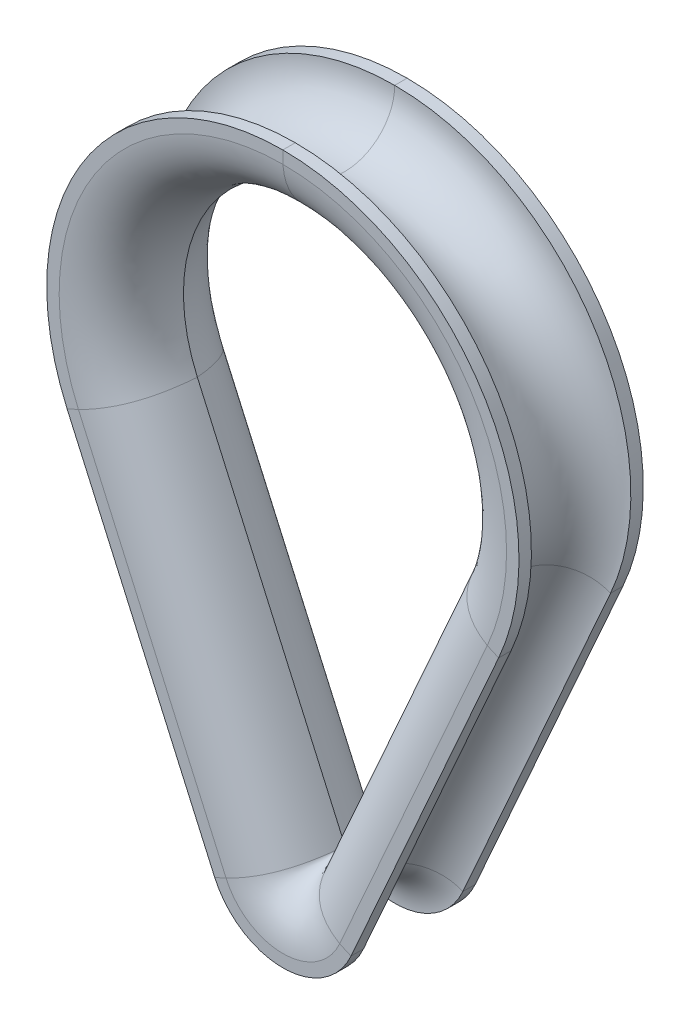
ISO-10303-21;
HEADER;
FILE_DESCRIPTION(('STEP AP214'),'2;1');
FILE_NAME('part.step','',(''),(''),'','','');
FILE_SCHEMA(('AUTOMOTIVE_DESIGN { 1 0 10303 214 1 1 1 1 }'));
ENDSEC;
DATA;
#1=APPLICATION_CONTEXT('core data for automotive mechanical design processes');
#2=APPLICATION_PROTOCOL_DEFINITION('international standard','automotive_design',2000,#1);
#3=PRODUCT_CONTEXT('',#1,'mechanical');
#4=PRODUCT('Part','Part','',(#3));
#5=PRODUCT_RELATED_PRODUCT_CATEGORY('part','',(#4));
#6=PRODUCT_DEFINITION_FORMATION('','',#4);
#7=PRODUCT_DEFINITION_CONTEXT('part definition',#1,'design');
#8=PRODUCT_DEFINITION('design','',#6,#7);
#9=PRODUCT_DEFINITION_SHAPE('','',#8);
#10=(LENGTH_UNIT() NAMED_UNIT(*) SI_UNIT(.MILLI.,.METRE.));
#11=(NAMED_UNIT(*) PLANE_ANGLE_UNIT() SI_UNIT($,.RADIAN.));
#12=(NAMED_UNIT(*) SI_UNIT($,.STERADIAN.) SOLID_ANGLE_UNIT());
#13=UNCERTAINTY_MEASURE_WITH_UNIT(LENGTH_MEASURE(1.E-05),#10,'distance_accuracy_value','');
#14=(GEOMETRIC_REPRESENTATION_CONTEXT(3) GLOBAL_UNCERTAINTY_ASSIGNED_CONTEXT((#13)) GLOBAL_UNIT_ASSIGNED_CONTEXT((#10,
#11,#12)) REPRESENTATION_CONTEXT('',''));
#15=CARTESIAN_POINT('',(0.,0.,0.));
#16=DIRECTION('',(0.,0.,1.));
#17=DIRECTION('',(1.,0.,0.));
#18=AXIS2_PLACEMENT_3D('',#15,#16,#17);
#19=CARTESIAN_POINT('',(0.,0.,0.));
#20=DIRECTION('',(0.,0.,-1.));
#21=DIRECTION('',(-1.,0.,0.));
#22=AXIS2_PLACEMENT_3D('',#19,#20,#21);
#23=CYLINDRICAL_SURFACE('',#22,19.);
#24=CARTESIAN_POINT('',(0.,0.,4.));
#25=DIRECTION('',(0.,0.,-1.));
#26=DIRECTION('',(-0.913761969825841,-0.40625,0.));
#27=AXIS2_PLACEMENT_3D('',#24,#25,#26);
#28=CIRCLE('',#27,19.);
#29=CARTESIAN_POINT('',(-17.361477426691,-7.71874999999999,4.));
#30=VERTEX_POINT('',#29);
#31=CARTESIAN_POINT('',(0.,19.,4.));
#32=VERTEX_POINT('',#31);
#33=EDGE_CURVE('E11',#30,#32,#28,.T.);
#34=ORIENTED_EDGE('',*,*,#33,.F.);
#35=DIRECTION('',(0.,0.,1.));
#36=VECTOR('',#35,1.);
#37=CARTESIAN_POINT('',(-17.361477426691,-7.71875,5.));
#38=LINE('',#37,#36);
#39=CARTESIAN_POINT('',(-17.361477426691,-7.71874999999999,5.));
#40=VERTEX_POINT('',#39);
#41=EDGE_CURVE('E45',#30,#40,#38,.T.);
#42=ORIENTED_EDGE('',*,*,#41,.T.);
#43=CARTESIAN_POINT('',(0.,0.,5.));
#44=DIRECTION('',(0.,0.,-1.));
#45=DIRECTION('',(-0.913761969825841,-0.40625,0.));
#46=AXIS2_PLACEMENT_3D('',#43,#44,#45);
#47=CIRCLE('',#46,19.);
#48=CARTESIAN_POINT('',(0.,19.,5.));
#49=VERTEX_POINT('',#48);
#50=EDGE_CURVE('E211',#40,#49,#47,.T.);
#51=ORIENTED_EDGE('',*,*,#50,.T.);
#52=DIRECTION('',(0.,0.,1.));
#53=VECTOR('',#52,1.);
#54=CARTESIAN_POINT('',(0.,19.,5.));
#55=LINE('',#54,#53);
#56=EDGE_CURVE('E389',#32,#49,#55,.T.);
#57=ORIENTED_EDGE('',*,*,#56,.F.);
#58=EDGE_LOOP('',(#34,#42,#51,#57));
#59=FACE_BOUND('',#58,.T.);
#60=ADVANCED_FACE('F39',(#59),#23,.T.);
#61=CARTESIAN_POINT('',(0.,0.,0.));
#62=DIRECTION('',(0.,0.,-1.));
#63=DIRECTION('',(-1.,0.,0.));
#64=AXIS2_PLACEMENT_3D('',#61,#62,#63);
#65=TOROIDAL_SURFACE('',#64,19.,4.);
#66=CARTESIAN_POINT('',(0.,0.,-4.));
#67=DIRECTION('',(0.,0.,-1.));
#68=DIRECTION('',(-0.913761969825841,-0.40625,0.));
#69=AXIS2_PLACEMENT_3D('',#66,#67,#68);
#70=CIRCLE('',#69,19.);
#71=CARTESIAN_POINT('',(-17.361477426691,-7.71874999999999,-4.));
#72=VERTEX_POINT('',#71);
#73=CARTESIAN_POINT('',(0.,19.,-4.));
#74=VERTEX_POINT('',#73);
#75=EDGE_CURVE('E50',#72,#74,#70,.T.);
#76=ORIENTED_EDGE('',*,*,#75,.F.);
#77=CARTESIAN_POINT('',(-17.361477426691,-7.71875,0.));
#78=DIRECTION('',(0.40625,-0.913761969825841,0.));
#79=DIRECTION('',(0.,0.,-1.));
#80=AXIS2_PLACEMENT_3D('',#77,#78,#79);
#81=CIRCLE('',#80,4.);
#82=EDGE_CURVE('E383',#72,#30,#81,.T.);
#83=ORIENTED_EDGE('',*,*,#82,.T.);
#84=ORIENTED_EDGE('',*,*,#33,.T.);
#85=CARTESIAN_POINT('',(0.,19.,0.));
#86=DIRECTION('',(-1.,0.,0.));
#87=DIRECTION('',(0.,0.,-1.));
#88=AXIS2_PLACEMENT_3D('',#85,#86,#87);
#89=CIRCLE('',#88,4.);
#90=EDGE_CURVE('E365',#74,#32,#89,.T.);
#91=ORIENTED_EDGE('',*,*,#90,.F.);
#92=EDGE_LOOP('',(#76,#83,#84,#91));
#93=FACE_BOUND('',#92,.T.);
#94=ADVANCED_FACE('F457',(#93),#65,.F.);
#95=CARTESIAN_POINT('',(0.,0.,0.));
#96=DIRECTION('',(0.,0.,-1.));
#97=DIRECTION('',(-1.,0.,0.));
#98=AXIS2_PLACEMENT_3D('',#95,#96,#97);
#99=CYLINDRICAL_SURFACE('',#98,19.);
#100=CARTESIAN_POINT('',(0.,0.,-5.));
#101=DIRECTION('',(0.,0.,-1.));
#102=DIRECTION('',(-0.913761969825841,-0.40625,0.));
#103=AXIS2_PLACEMENT_3D('',#100,#101,#102);
#104=CIRCLE('',#103,19.);
#105=CARTESIAN_POINT('',(-17.361477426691,-7.71874999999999,-5.));
#106=VERTEX_POINT('',#105);
#107=CARTESIAN_POINT('',(0.,19.,-5.));
#108=VERTEX_POINT('',#107);
#109=EDGE_CURVE('E338',#106,#108,#104,.T.);
#110=ORIENTED_EDGE('',*,*,#109,.F.);
#111=DIRECTION('',(0.,0.,1.));
#112=VECTOR('',#111,1.);
#113=CARTESIAN_POINT('',(-17.361477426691,-7.71875,-5.));
#114=LINE('',#113,#112);
#115=EDGE_CURVE('E360',#106,#72,#114,.T.);
#116=ORIENTED_EDGE('',*,*,#115,.T.);
#117=ORIENTED_EDGE('',*,*,#75,.T.);
#118=DIRECTION('',(0.,0.,1.));
#119=VECTOR('',#118,1.);
#120=CARTESIAN_POINT('',(0.,19.,-5.));
#121=LINE('',#120,#119);
#122=EDGE_CURVE('E342',#108,#74,#121,.T.);
#123=ORIENTED_EDGE('',*,*,#122,.F.);
#124=EDGE_LOOP('',(#110,#116,#117,#123));
#125=FACE_BOUND('',#124,.T.);
#126=ADVANCED_FACE('F462',(#125),#99,.T.);
#127=CARTESIAN_POINT('',(-17.361477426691,-7.71875,-5.));
#128=DIRECTION('',(0.,0.,-1.));
#129=DIRECTION('',(-1.,0.,0.));
#130=AXIS2_PLACEMENT_3D('',#127,#128,#129);
#131=PLANE('',#130);
#132=CARTESIAN_POINT('',(0.,0.,-5.));
#133=DIRECTION('',(0.,0.,-1.));
#134=DIRECTION('',(-0.913761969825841,-0.40625,0.));
#135=AXIS2_PLACEMENT_3D('',#132,#133,#134);
#136=CIRCLE('',#135,18.);
#137=CARTESIAN_POINT('',(-16.4477154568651,-7.31249999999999,-5.));
#138=VERTEX_POINT('',#137);
#139=CARTESIAN_POINT('',(0.,18.,-5.));
#140=VERTEX_POINT('',#139);
#141=EDGE_CURVE('E175',#138,#140,#136,.T.);
#142=ORIENTED_EDGE('',*,*,#141,.F.);
#143=DIRECTION('',(-0.913761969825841,-0.40625,0.));
#144=VECTOR('',#143,1.);
#145=CARTESIAN_POINT('',(-17.361477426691,-7.71875,-5.));
#146=LINE('',#145,#144);
#147=EDGE_CURVE('E337',#138,#106,#146,.T.);
#148=ORIENTED_EDGE('',*,*,#147,.T.);
#149=ORIENTED_EDGE('',*,*,#109,.T.);
#150=DIRECTION('',(0.,1.,0.));
#151=VECTOR('',#150,1.);
#152=CARTESIAN_POINT('',(0.,19.,-5.));
#153=LINE('',#152,#151);
#154=EDGE_CURVE('E293',#140,#108,#153,.T.);
#155=ORIENTED_EDGE('',*,*,#154,.F.);
#156=EDGE_LOOP('',(#142,#148,#149,#155));
#157=FACE_BOUND('',#156,.T.);
#158=ADVANCED_FACE('F469',(#157),#131,.T.);
#159=CARTESIAN_POINT('',(-11.8789056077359,-5.28125,0.));
#160=CARTESIAN_POINT('',(-16.1172272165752,4.25183825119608,0.));
#161=CARTESIAN_POINT('',(-10.4327916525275,13.,0.));
#162=CARTESIAN_POINT('',(0.,13.,0.));
#163=CARTESIAN_POINT('',(-12.6159607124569,-5.60893778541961,-4.6540376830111));
#164=CARTESIAN_POINT('',(-17.1172591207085,4.51565372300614,-4.6540376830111));
#165=CARTESIAN_POINT('',(-11.0801191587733,13.8066160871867,-4.6540376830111));
#166=CARTESIAN_POINT('',(0.,13.8066160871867,-4.6540376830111));
#167=CARTESIAN_POINT('',(-16.4477154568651,-7.3125,-5.));
#168=CARTESIAN_POINT('',(-22.3161607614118,5.88716065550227,-5.));
#169=CARTESIAN_POINT('',(-14.4454038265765,18.,-5.));
#170=CARTESIAN_POINT('',(0.,18.,-5.));
#171=(BOUNDED_SURFACE() B_SPLINE_SURFACE(2,3,((#159,#160,#161,#162),(#163,#164,#165,#166),(#167,
#168,#169,#170)),.UNSPECIFIED.,.F.,.F.,.F.) B_SPLINE_SURFACE_WITH_KNOTS((3,3),(4,4),(0.,1.),(0.,
1.),.UNSPECIFIED.) GEOMETRIC_REPRESENTATION_ITEM() RATIONAL_B_SPLINE_SURFACE(((1.,
0.696574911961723,0.696574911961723,1.),(1.,0.696574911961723,0.696574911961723,1.),(1.,
0.696574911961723,0.696574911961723,1.))) REPRESENTATION_ITEM('') SURFACE());
#172=CARTESIAN_POINT('',(0.,0.,0.));
#173=DIRECTION('',(0.,0.,-1.));
#174=DIRECTION('',(-0.913761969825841,-0.40625,0.));
#175=AXIS2_PLACEMENT_3D('',#172,#173,#174);
#176=CIRCLE('',#175,13.);
#177=CARTESIAN_POINT('',(-11.8789056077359,-5.28124999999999,0.));
#178=VERTEX_POINT('',#177);
#179=CARTESIAN_POINT('',(0.,13.,0.));
#180=VERTEX_POINT('',#179);
#181=EDGE_CURVE('E185',#178,#180,#176,.T.);
#182=CARTESIAN_POINT('',(-11.8789056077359,-5.28125,0.));
#183=CARTESIAN_POINT('',(-12.6159607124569,-5.60893778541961,-4.6540376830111));
#184=CARTESIAN_POINT('',(-16.4477154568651,-7.3125,-5.));
#185=B_SPLINE_CURVE_WITH_KNOTS('',2,(#182,#183,#184),.UNSPECIFIED.,.F.,.F.,(3,3),(0.,1.),.UNSPECIFIED.);
#186=EDGE_CURVE('E288',#178,#138,#185,.T.);
#187=CARTESIAN_POINT('',(0.,13.,0.));
#188=CARTESIAN_POINT('',(0.,13.8066160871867,-4.6540376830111));
#189=CARTESIAN_POINT('',(0.,18.,-5.));
#190=B_SPLINE_CURVE_WITH_KNOTS('',2,(#187,#188,#189),.UNSPECIFIED.,.F.,.F.,(3,3),(0.,1.),.UNSPECIFIED.);
#191=EDGE_CURVE('E246',#180,#140,#190,.T.);
#192=ORIENTED_EDGE('',*,*,#181,.F.);
#193=ORIENTED_EDGE('',*,*,#186,.T.);
#194=ORIENTED_EDGE('',*,*,#141,.T.);
#195=ORIENTED_EDGE('',*,*,#191,.F.);
#196=EDGE_LOOP('',(#192,#193,#194,#195));
#197=FACE_BOUND('',#196,.T.);
#198=ADVANCED_FACE('F472',(#197),#171,.T.);
#199=CARTESIAN_POINT('',(-16.4477154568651,-7.3125,5.));
#200=CARTESIAN_POINT('',(-22.3161607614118,5.88716065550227,5.));
#201=CARTESIAN_POINT('',(-14.4454038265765,18.,5.));
#202=CARTESIAN_POINT('',(0.,18.,5.));
#203=CARTESIAN_POINT('',(-12.6159607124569,-5.60893778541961,4.6540376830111));
#204=CARTESIAN_POINT('',(-17.1172591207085,4.51565372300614,4.6540376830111));
#205=CARTESIAN_POINT('',(-11.0801191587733,13.8066160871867,4.6540376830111));
#206=CARTESIAN_POINT('',(0.,13.8066160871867,4.6540376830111));
#207=CARTESIAN_POINT('',(-11.8789056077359,-5.28125,0.));
#208=CARTESIAN_POINT('',(-16.1172272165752,4.25183825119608,0.));
#209=CARTESIAN_POINT('',(-10.4327916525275,13.,0.));
#210=CARTESIAN_POINT('',(0.,13.,0.));
#211=(BOUNDED_SURFACE() B_SPLINE_SURFACE(2,3,((#199,#200,#201,#202),(#203,#204,#205,#206),(#207,
#208,#209,#210)),.UNSPECIFIED.,.F.,.F.,.F.) B_SPLINE_SURFACE_WITH_KNOTS((3,3),(4,4),(0.,1.),(0.,
1.),.UNSPECIFIED.) GEOMETRIC_REPRESENTATION_ITEM() RATIONAL_B_SPLINE_SURFACE(((1.,
0.696574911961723,0.696574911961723,1.),(1.,0.696574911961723,0.696574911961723,1.),(1.,
0.696574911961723,0.696574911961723,1.))) REPRESENTATION_ITEM('') SURFACE());
#212=CARTESIAN_POINT('',(0.,0.,5.));
#213=DIRECTION('',(0.,0.,-1.));
#214=DIRECTION('',(-0.913761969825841,-0.40625,0.));
#215=AXIS2_PLACEMENT_3D('',#212,#213,#214);
#216=CIRCLE('',#215,18.);
#217=CARTESIAN_POINT('',(-16.4477154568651,-7.31249999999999,5.));
#218=VERTEX_POINT('',#217);
#219=CARTESIAN_POINT('',(0.,18.,5.));
#220=VERTEX_POINT('',#219);
#221=EDGE_CURVE('E191',#218,#220,#216,.T.);
#222=CARTESIAN_POINT('',(-16.4477154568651,-7.3125,5.));
#223=CARTESIAN_POINT('',(-12.6159607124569,-5.60893778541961,4.6540376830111));
#224=CARTESIAN_POINT('',(-11.8789056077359,-5.28125,0.));
#225=B_SPLINE_CURVE_WITH_KNOTS('',2,(#222,#223,#224),.UNSPECIFIED.,.F.,.F.,(3,3),(0.,1.),.UNSPECIFIED.);
#226=EDGE_CURVE('E210',#218,#178,#225,.T.);
#227=CARTESIAN_POINT('',(0.,18.,5.));
#228=CARTESIAN_POINT('',(0.,13.8066160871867,4.6540376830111));
#229=CARTESIAN_POINT('',(0.,13.,0.));
#230=B_SPLINE_CURVE_WITH_KNOTS('',2,(#227,#228,#229),.UNSPECIFIED.,.F.,.F.,(3,3),(0.,1.),.UNSPECIFIED.);
#231=EDGE_CURVE('E207',#220,#180,#230,.T.);
#232=ORIENTED_EDGE('',*,*,#221,.F.);
#233=ORIENTED_EDGE('',*,*,#226,.T.);
#234=ORIENTED_EDGE('',*,*,#181,.T.);
#235=ORIENTED_EDGE('',*,*,#231,.F.);
#236=EDGE_LOOP('',(#232,#233,#234,#235));
#237=FACE_BOUND('',#236,.T.);
#238=ADVANCED_FACE('F206',(#237),#211,.T.);
#239=CARTESIAN_POINT('',(-5.48257181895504,-34.4375,5.));
#240=DIRECTION('',(-0.91376196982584,-0.40625,0.));
#241=DIRECTION('',(0.40625,-0.91376196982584,0.));
#242=AXIS2_PLACEMENT_3D('',#239,#240,#241);
#243=PLANE('',#242);
#244=ORIENTED_EDGE('',*,*,#41,.F.);
#245=DIRECTION('',(-0.40625,0.91376196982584,0.));
#246=VECTOR('',#245,1.);
#247=CARTESIAN_POINT('',(-5.48257181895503,-34.4375,4.));
#248=LINE('',#247,#246);
#249=CARTESIAN_POINT('',(-5.48257181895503,-34.4375,4.));
#250=VERTEX_POINT('',#249);
#251=EDGE_CURVE('E404',#250,#30,#248,.T.);
#252=ORIENTED_EDGE('',*,*,#251,.F.);
#253=DIRECTION('',(0.,0.,1.));
#254=VECTOR('',#253,1.);
#255=CARTESIAN_POINT('',(-5.48257181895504,-34.4375,5.));
#256=LINE('',#255,#254);
#257=CARTESIAN_POINT('',(-5.48257181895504,-34.4375,5.));
#258=VERTEX_POINT('',#257);
#259=EDGE_CURVE('E237',#250,#258,#256,.T.);
#260=ORIENTED_EDGE('',*,*,#259,.T.);
#261=DIRECTION('',(-0.40625,0.91376196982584,0.));
#262=VECTOR('',#261,1.);
#263=CARTESIAN_POINT('',(-5.48257181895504,-34.4375,5.));
#264=LINE('',#263,#262);
#265=EDGE_CURVE('E233',#258,#40,#264,.T.);
#266=ORIENTED_EDGE('',*,*,#265,.T.);
#267=EDGE_LOOP('',(#244,#252,#260,#266));
#268=FACE_BOUND('',#267,.T.);
#269=ADVANCED_FACE('F417',(#268),#243,.T.);
#270=CARTESIAN_POINT('',(-5.48257181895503,-34.4375,0.));
#271=DIRECTION('',(-0.40625,0.91376196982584,0.));
#272=DIRECTION('',(-0.91376196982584,-0.40625,0.));
#273=AXIS2_PLACEMENT_3D('',#270,#271,#272);
#274=CYLINDRICAL_SURFACE('',#273,4.);
#275=ORIENTED_EDGE('',*,*,#251,.T.);
#276=ORIENTED_EDGE('',*,*,#82,.F.);
#277=DIRECTION('',(-0.40625,0.91376196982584,0.));
#278=VECTOR('',#277,1.);
#279=CARTESIAN_POINT('',(-5.48257181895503,-34.4375,-4.));
#280=LINE('',#279,#278);
#281=CARTESIAN_POINT('',(-5.48257181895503,-34.4375,-4.));
#282=VERTEX_POINT('',#281);
#283=EDGE_CURVE('E381',#282,#72,#280,.T.);
#284=ORIENTED_EDGE('',*,*,#283,.F.);
#285=CARTESIAN_POINT('',(-5.48257181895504,-34.4375,0.));
#286=DIRECTION('',(0.406250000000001,-0.91376196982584,0.));
#287=DIRECTION('',(0.,0.,-1.));
#288=AXIS2_PLACEMENT_3D('',#285,#286,#287);
#289=CIRCLE('',#288,4.);
#290=EDGE_CURVE('E380',#282,#250,#289,.T.);
#291=ORIENTED_EDGE('',*,*,#290,.T.);
#292=EDGE_LOOP('',(#275,#276,#284,#291));
#293=FACE_BOUND('',#292,.T.);
#294=ADVANCED_FACE('F514',(#293),#274,.F.);
#295=CARTESIAN_POINT('',(-5.48257181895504,-34.4375,-5.));
#296=DIRECTION('',(-0.91376196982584,-0.40625,0.));
#297=DIRECTION('',(0.40625,-0.91376196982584,0.));
#298=AXIS2_PLACEMENT_3D('',#295,#296,#297);
#299=PLANE('',#298);
#300=ORIENTED_EDGE('',*,*,#283,.T.);
#301=ORIENTED_EDGE('',*,*,#115,.F.);
#302=DIRECTION('',(-0.40625,0.91376196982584,0.));
#303=VECTOR('',#302,1.);
#304=CARTESIAN_POINT('',(-5.48257181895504,-34.4375,-5.));
#305=LINE('',#304,#303);
#306=CARTESIAN_POINT('',(-5.48257181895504,-34.4375,-5.));
#307=VERTEX_POINT('',#306);
#308=EDGE_CURVE('E357',#307,#106,#305,.T.);
#309=ORIENTED_EDGE('',*,*,#308,.F.);
#310=DIRECTION('',(0.,0.,1.));
#311=VECTOR('',#310,1.);
#312=CARTESIAN_POINT('',(-5.48257181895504,-34.4375,-5.));
#313=LINE('',#312,#311);
#314=EDGE_CURVE('E354',#307,#282,#313,.T.);
#315=ORIENTED_EDGE('',*,*,#314,.T.);
#316=EDGE_LOOP('',(#300,#301,#309,#315));
#317=FACE_BOUND('',#316,.T.);
#318=ADVANCED_FACE('F526',(#317),#299,.T.);
#319=CARTESIAN_POINT('',(-5.48257181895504,-34.4375,-5.));
#320=DIRECTION('',(0.,0.,-1.));
#321=DIRECTION('',(-1.,0.,0.));
#322=AXIS2_PLACEMENT_3D('',#319,#320,#321);
#323=PLANE('',#322);
#324=ORIENTED_EDGE('',*,*,#308,.T.);
#325=ORIENTED_EDGE('',*,*,#147,.F.);
#326=DIRECTION('',(-0.40625,0.91376196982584,0.));
#327=VECTOR('',#326,1.);
#328=CARTESIAN_POINT('',(-4.5688098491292,-34.03125,-5.));
#329=LINE('',#328,#327);
#330=CARTESIAN_POINT('',(-4.5688098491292,-34.03125,-5.));
#331=VERTEX_POINT('',#330);
#332=EDGE_CURVE('E332',#331,#138,#329,.T.);
#333=ORIENTED_EDGE('',*,*,#332,.F.);
#334=DIRECTION('',(-0.91376196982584,-0.406250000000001,0.));
#335=VECTOR('',#334,1.);
#336=CARTESIAN_POINT('',(-5.48257181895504,-34.4375,-5.));
#337=LINE('',#336,#335);
#338=EDGE_CURVE('E325',#331,#307,#337,.T.);
#339=ORIENTED_EDGE('',*,*,#338,.T.);
#340=EDGE_LOOP('',(#324,#325,#333,#339));
#341=FACE_BOUND('',#340,.T.);
#342=ADVANCED_FACE('F572',(#341),#323,.T.);
#343=CARTESIAN_POINT('',(0.,-32.,0.));
#344=CARTESIAN_POINT('',(-11.8789056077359,-5.28125,0.));
#345=CARTESIAN_POINT('',(-0.737055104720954,-32.3276877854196,-4.6540376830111));
#346=CARTESIAN_POINT('',(-12.6159607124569,-5.60893778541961,-4.6540376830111));
#347=CARTESIAN_POINT('',(-4.5688098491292,-34.03125,-5.));
#348=CARTESIAN_POINT('',(-16.4477154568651,-7.3125,-5.));
#349=B_SPLINE_SURFACE_WITH_KNOTS('',2,1,((#343,#344),(#345,#346),(#347,#348)),.UNSPECIFIED.,.F.,
.F.,.F.,(3,3),(2,2),(0.,1.),(0.,1.),.UNSPECIFIED.);
#350=DIRECTION('',(-0.40625,0.91376196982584,0.));
#351=VECTOR('',#350,1.);
#352=CARTESIAN_POINT('',(0.,-32.,0.));
#353=LINE('',#352,#351);
#354=CARTESIAN_POINT('',(0.,-32.,0.));
#355=VERTEX_POINT('',#354);
#356=EDGE_CURVE('E222',#355,#178,#353,.T.);
#357=CARTESIAN_POINT('',(0.,-32.,0.));
#358=CARTESIAN_POINT('',(-0.73705510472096,-32.3276877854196,-4.6540376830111));
#359=CARTESIAN_POINT('',(-4.5688098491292,-34.03125,-5.));
#360=B_SPLINE_CURVE_WITH_KNOTS('',2,(#357,#358,#359),.UNSPECIFIED.,.F.,.F.,(3,3),(0.,1.),.UNSPECIFIED.);
#361=EDGE_CURVE('E279',#355,#331,#360,.T.);
#362=ORIENTED_EDGE('',*,*,#332,.T.);
#363=ORIENTED_EDGE('',*,*,#186,.F.);
#364=ORIENTED_EDGE('',*,*,#356,.F.);
#365=ORIENTED_EDGE('',*,*,#361,.T.);
#366=EDGE_LOOP('',(#362,#363,#364,#365));
#367=FACE_BOUND('',#366,.T.);
#368=ADVANCED_FACE('F490',(#367),#349,.T.);
#369=CARTESIAN_POINT('',(-4.5688098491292,-34.03125,5.));
#370=CARTESIAN_POINT('',(-16.4477154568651,-7.3125,5.));
#371=CARTESIAN_POINT('',(-0.737055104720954,-32.3276877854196,4.6540376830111));
#372=CARTESIAN_POINT('',(-12.6159607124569,-5.60893778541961,4.6540376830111));
#373=CARTESIAN_POINT('',(0.,-32.,0.));
#374=CARTESIAN_POINT('',(-11.8789056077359,-5.28125,0.));
#375=B_SPLINE_SURFACE_WITH_KNOTS('',2,1,((#369,#370),(#371,#372),(#373,#374)),.UNSPECIFIED.,.F.,
.F.,.F.,(3,3),(2,2),(0.,1.),(0.,1.),.UNSPECIFIED.);
#376=DIRECTION('',(-0.40625,0.91376196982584,0.));
#377=VECTOR('',#376,1.);
#378=CARTESIAN_POINT('',(-4.5688098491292,-34.03125,5.));
#379=LINE('',#378,#377);
#380=CARTESIAN_POINT('',(-4.5688098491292,-34.03125,5.));
#381=VERTEX_POINT('',#380);
#382=EDGE_CURVE('E217',#381,#218,#379,.T.);
#383=CARTESIAN_POINT('',(-4.5688098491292,-34.03125,5.));
#384=CARTESIAN_POINT('',(-0.73705510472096,-32.3276877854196,4.6540376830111));
#385=CARTESIAN_POINT('',(0.,-32.,0.));
#386=B_SPLINE_CURVE_WITH_KNOTS('',2,(#383,#384,#385),.UNSPECIFIED.,.F.,.F.,(3,3),(0.,1.),.UNSPECIFIED.);
#387=EDGE_CURVE('E274',#381,#355,#386,.T.);
#388=ORIENTED_EDGE('',*,*,#356,.T.);
#389=ORIENTED_EDGE('',*,*,#226,.F.);
#390=ORIENTED_EDGE('',*,*,#382,.F.);
#391=ORIENTED_EDGE('',*,*,#387,.T.);
#392=EDGE_LOOP('',(#388,#389,#390,#391));
#393=FACE_BOUND('',#392,.T.);
#394=ADVANCED_FACE('F220',(#393),#375,.T.);
#395=CARTESIAN_POINT('',(-5.48257181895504,-34.4375,5.));
#396=DIRECTION('',(0.,0.,1.));
#397=DIRECTION('',(1.,0.,0.));
#398=AXIS2_PLACEMENT_3D('',#395,#396,#397);
#399=PLANE('',#398);
#400=ORIENTED_EDGE('',*,*,#382,.T.);
#401=DIRECTION('',(0.913761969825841,0.40625,0.));
#402=VECTOR('',#401,1.);
#403=CARTESIAN_POINT('',(-17.361477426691,-7.71875,5.));
#404=LINE('',#403,#402);
#405=EDGE_CURVE('E229',#40,#218,#404,.T.);
#406=ORIENTED_EDGE('',*,*,#405,.F.);
#407=ORIENTED_EDGE('',*,*,#265,.F.);
#408=DIRECTION('',(0.91376196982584,0.406250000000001,0.));
#409=VECTOR('',#408,1.);
#410=CARTESIAN_POINT('',(-5.48257181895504,-34.4375,5.));
#411=LINE('',#410,#409);
#412=EDGE_CURVE('E231',#258,#381,#411,.T.);
#413=ORIENTED_EDGE('',*,*,#412,.T.);
#414=EDGE_LOOP('',(#400,#406,#407,#413));
#415=FACE_BOUND('',#414,.T.);
#416=ADVANCED_FACE('F226',(#415),#399,.T.);
#417=CARTESIAN_POINT('',(0.,-32.,0.));
#418=DIRECTION('',(0.,0.,-1.));
#419=DIRECTION('',(-1.,0.,0.));
#420=AXIS2_PLACEMENT_3D('',#417,#418,#419);
#421=CYLINDRICAL_SURFACE('',#420,6.);
#422=ORIENTED_EDGE('',*,*,#259,.F.);
#423=CARTESIAN_POINT('',(0.,-32.,4.));
#424=DIRECTION('',(0.,0.,-1.));
#425=DIRECTION('',(0.913761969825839,-0.406250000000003,0.));
#426=AXIS2_PLACEMENT_3D('',#423,#424,#425);
#427=CIRCLE('',#426,6.);
#428=CARTESIAN_POINT('',(5.48257181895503,-34.4375,4.));
#429=VERTEX_POINT('',#428);
#430=EDGE_CURVE('E90',#429,#250,#427,.T.);
#431=ORIENTED_EDGE('',*,*,#430,.F.);
#432=DIRECTION('',(0.,0.,1.));
#433=VECTOR('',#432,1.);
#434=CARTESIAN_POINT('',(5.48257181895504,-34.4375,5.));
#435=LINE('',#434,#433);
#436=CARTESIAN_POINT('',(5.48257181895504,-34.4375,5.));
#437=VERTEX_POINT('',#436);
#438=EDGE_CURVE('E398',#429,#437,#435,.T.);
#439=ORIENTED_EDGE('',*,*,#438,.T.);
#440=CARTESIAN_POINT('',(0.,-32.,5.));
#441=DIRECTION('',(0.,0.,-1.));
#442=DIRECTION('',(0.913761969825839,-0.406250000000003,0.));
#443=AXIS2_PLACEMENT_3D('',#440,#441,#442);
#444=CIRCLE('',#443,6.);
#445=EDGE_CURVE('E239',#437,#258,#444,.T.);
#446=ORIENTED_EDGE('',*,*,#445,.T.);
#447=EDGE_LOOP('',(#422,#431,#439,#446));
#448=FACE_BOUND('',#447,.T.);
#449=ADVANCED_FACE('F422',(#448),#421,.T.);
#450=CARTESIAN_POINT('',(0.,-32.,0.));
#451=DIRECTION('',(0.,0.,-1.));
#452=DIRECTION('',(-1.,0.,0.));
#453=AXIS2_PLACEMENT_3D('',#450,#451,#452);
#454=TOROIDAL_SURFACE('',#453,6.,4.);
#455=ORIENTED_EDGE('',*,*,#430,.T.);
#456=ORIENTED_EDGE('',*,*,#290,.F.);
#457=CARTESIAN_POINT('',(0.,-32.,-4.));
#458=DIRECTION('',(0.,0.,-1.));
#459=DIRECTION('',(0.913761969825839,-0.406250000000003,0.));
#460=AXIS2_PLACEMENT_3D('',#457,#458,#459);
#461=CIRCLE('',#460,6.);
#462=CARTESIAN_POINT('',(5.48257181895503,-34.4375,-4.));
#463=VERTEX_POINT('',#462);
#464=EDGE_CURVE('E99',#463,#282,#461,.T.);
#465=ORIENTED_EDGE('',*,*,#464,.F.);
#466=CARTESIAN_POINT('',(5.48257181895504,-34.4375,0.));
#467=DIRECTION('',(0.40625,0.91376196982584,0.));
#468=DIRECTION('',(0.,0.,-1.));
#469=AXIS2_PLACEMENT_3D('',#466,#467,#468);
#470=CIRCLE('',#469,4.);
#471=EDGE_CURVE('E372',#463,#429,#470,.T.);
#472=ORIENTED_EDGE('',*,*,#471,.T.);
#473=EDGE_LOOP('',(#455,#456,#465,#472));
#474=FACE_BOUND('',#473,.T.);
#475=ADVANCED_FACE('F522',(#474),#454,.F.);
#476=CARTESIAN_POINT('',(0.,-32.,0.));
#477=DIRECTION('',(0.,0.,-1.));
#478=DIRECTION('',(-1.,0.,0.));
#479=AXIS2_PLACEMENT_3D('',#476,#477,#478);
#480=CYLINDRICAL_SURFACE('',#479,6.);
#481=ORIENTED_EDGE('',*,*,#464,.T.);
#482=ORIENTED_EDGE('',*,*,#314,.F.);
#483=CARTESIAN_POINT('',(0.,-32.,-5.));
#484=DIRECTION('',(0.,0.,-1.));
#485=DIRECTION('',(0.913761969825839,-0.406250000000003,0.));
#486=AXIS2_PLACEMENT_3D('',#483,#484,#485);
#487=CIRCLE('',#486,6.);
#488=CARTESIAN_POINT('',(5.48257181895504,-34.4375,-5.));
#489=VERTEX_POINT('',#488);
#490=EDGE_CURVE('E108',#489,#307,#487,.T.);
#491=ORIENTED_EDGE('',*,*,#490,.F.);
#492=DIRECTION('',(0.,0.,1.));
#493=VECTOR('',#492,1.);
#494=CARTESIAN_POINT('',(5.48257181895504,-34.4375,-5.));
#495=LINE('',#494,#493);
#496=EDGE_CURVE('E348',#489,#463,#495,.T.);
#497=ORIENTED_EDGE('',*,*,#496,.T.);
#498=EDGE_LOOP('',(#481,#482,#491,#497));
#499=FACE_BOUND('',#498,.T.);
#500=ADVANCED_FACE('F571',(#499),#480,.T.);
#501=CARTESIAN_POINT('',(5.48257181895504,-34.4375,-5.));
#502=DIRECTION('',(0.,0.,-1.));
#503=DIRECTION('',(-1.,0.,0.));
#504=AXIS2_PLACEMENT_3D('',#501,#502,#503);
#505=PLANE('',#504);
#506=ORIENTED_EDGE('',*,*,#490,.T.);
#507=ORIENTED_EDGE('',*,*,#338,.F.);
#508=CARTESIAN_POINT('',(0.,-32.,-5.));
#509=DIRECTION('',(0.,0.,-1.));
#510=DIRECTION('',(0.913761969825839,-0.406250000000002,0.));
#511=AXIS2_PLACEMENT_3D('',#508,#509,#510);
#512=CIRCLE('',#511,5.);
#513=CARTESIAN_POINT('',(4.5688098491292,-34.03125,-5.));
#514=VERTEX_POINT('',#513);
#515=EDGE_CURVE('E126',#514,#331,#512,.T.);
#516=ORIENTED_EDGE('',*,*,#515,.F.);
#517=DIRECTION('',(0.91376196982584,-0.40625,0.));
#518=VECTOR('',#517,1.);
#519=CARTESIAN_POINT('',(5.48257181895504,-34.4375,-5.));
#520=LINE('',#519,#518);
#521=EDGE_CURVE('E320',#514,#489,#520,.T.);
#522=ORIENTED_EDGE('',*,*,#521,.T.);
#523=EDGE_LOOP('',(#506,#507,#516,#522));
#524=FACE_BOUND('',#523,.T.);
#525=ADVANCED_FACE('F566',(#524),#505,.T.);
#526=CARTESIAN_POINT('',(0.,-32.,0.));
#527=CARTESIAN_POINT('',(0.,-32.,0.));
#528=CARTESIAN_POINT('',(0.,-32.,0.));
#529=CARTESIAN_POINT('',(0.,-32.,0.));
#530=CARTESIAN_POINT('',(0.737055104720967,-32.3276877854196,-4.6540376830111));
#531=CARTESIAN_POINT('',(0.406651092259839,-33.07085239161,-4.6540376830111));
#532=CARTESIAN_POINT('',(-0.40665109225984,-33.07085239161,-4.65403768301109));
#533=CARTESIAN_POINT('',(-0.737055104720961,-32.3276877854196,-4.65403768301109));
#534=CARTESIAN_POINT('',(4.5688098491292,-34.03125,-5.));
#535=CARTESIAN_POINT('',(2.52072267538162,-38.6379310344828,-5.));
#536=CARTESIAN_POINT('',(-2.52072267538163,-38.6379310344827,-5.));
#537=CARTESIAN_POINT('',(-4.5688098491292,-34.03125,-5.));
#538=(BOUNDED_SURFACE() B_SPLINE_SURFACE(2,3,((#526,#527,#528,#529),(#530,#531,#532,#533),(#534,
#535,#536,#537)),.UNSPECIFIED.,.F.,.F.,.F.) B_SPLINE_SURFACE_WITH_KNOTS((3,3),(4,4),(0.,1.),(0.,
1.),.UNSPECIFIED.) GEOMETRIC_REPRESENTATION_ITEM() RATIONAL_B_SPLINE_SURFACE(((1.,
0.604166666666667,0.604166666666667,1.),(1.,0.604166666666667,0.604166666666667,1.),(1.,
0.604166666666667,0.604166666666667,1.))) REPRESENTATION_ITEM('') SURFACE());
#539=CARTESIAN_POINT('',(0.,-32.,0.));
#540=CARTESIAN_POINT('',(0.737055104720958,-32.3276877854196,-4.6540376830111));
#541=CARTESIAN_POINT('',(4.5688098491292,-34.03125,-5.));
#542=B_SPLINE_CURVE_WITH_KNOTS('',2,(#539,#540,#541),.UNSPECIFIED.,.F.,.F.,(3,3),(0.,1.),.UNSPECIFIED.);
#543=EDGE_CURVE('E273',#355,#514,#542,.T.);
#544=ORIENTED_EDGE('',*,*,#515,.T.);
#545=ORIENTED_EDGE('',*,*,#361,.F.);
#546=ORIENTED_EDGE('',*,*,#543,.T.);
#547=EDGE_LOOP('',(#544,#545,#546));
#548=FACE_BOUND('',#547,.T.);
#549=ADVANCED_FACE('F482',(#548),#538,.T.);
#550=CARTESIAN_POINT('',(4.5688098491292,-34.03125,5.));
#551=CARTESIAN_POINT('',(2.52072267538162,-38.6379310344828,5.));
#552=CARTESIAN_POINT('',(-2.52072267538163,-38.6379310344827,5.));
#553=CARTESIAN_POINT('',(-4.5688098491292,-34.03125,5.));
#554=CARTESIAN_POINT('',(0.737055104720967,-32.3276877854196,4.6540376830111));
#555=CARTESIAN_POINT('',(0.406651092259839,-33.07085239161,4.6540376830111));
#556=CARTESIAN_POINT('',(-0.40665109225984,-33.07085239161,4.65403768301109));
#557=CARTESIAN_POINT('',(-0.737055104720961,-32.3276877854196,4.65403768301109));
#558=CARTESIAN_POINT('',(0.,-32.,0.));
#559=CARTESIAN_POINT('',(0.,-32.,0.));
#560=CARTESIAN_POINT('',(0.,-32.,0.));
#561=CARTESIAN_POINT('',(0.,-32.,0.));
#562=(BOUNDED_SURFACE() B_SPLINE_SURFACE(2,3,((#550,#551,#552,#553),(#554,#555,#556,#557),(#558,
#559,#560,#561)),.UNSPECIFIED.,.F.,.F.,.F.) B_SPLINE_SURFACE_WITH_KNOTS((3,3),(4,4),(0.,1.),(0.,
1.),.UNSPECIFIED.) GEOMETRIC_REPRESENTATION_ITEM() RATIONAL_B_SPLINE_SURFACE(((1.,
0.604166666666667,0.604166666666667,1.),(1.,0.604166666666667,0.604166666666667,1.),(1.,
0.604166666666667,0.604166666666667,1.))) REPRESENTATION_ITEM('') SURFACE());
#563=CARTESIAN_POINT('',(4.5688098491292,-34.03125,5.));
#564=CARTESIAN_POINT('',(0.737055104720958,-32.3276877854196,4.6540376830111));
#565=CARTESIAN_POINT('',(0.,-32.,0.));
#566=B_SPLINE_CURVE_WITH_KNOTS('',2,(#563,#564,#565),.UNSPECIFIED.,.F.,.F.,(3,3),(0.,1.),.UNSPECIFIED.);
#567=CARTESIAN_POINT('',(4.5688098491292,-34.03125,5.));
#568=VERTEX_POINT('',#567);
#569=EDGE_CURVE('E262',#568,#355,#566,.T.);
#570=CARTESIAN_POINT('',(0.,-32.,5.));
#571=DIRECTION('',(0.,0.,-1.));
#572=DIRECTION('',(0.913761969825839,-0.406250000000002,0.));
#573=AXIS2_PLACEMENT_3D('',#570,#571,#572);
#574=CIRCLE('',#573,5.);
#575=EDGE_CURVE('E330',#568,#381,#574,.T.);
#576=ORIENTED_EDGE('',*,*,#569,.T.);
#577=ORIENTED_EDGE('',*,*,#387,.F.);
#578=ORIENTED_EDGE('',*,*,#575,.F.);
#579=EDGE_LOOP('',(#576,#577,#578));
#580=FACE_BOUND('',#579,.T.);
#581=ADVANCED_FACE('F481',(#580),#562,.T.);
#582=CARTESIAN_POINT('',(5.48257181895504,-34.4375,5.));
#583=DIRECTION('',(0.,0.,1.));
#584=DIRECTION('',(1.,0.,0.));
#585=AXIS2_PLACEMENT_3D('',#582,#583,#584);
#586=PLANE('',#585);
#587=ORIENTED_EDGE('',*,*,#575,.T.);
#588=ORIENTED_EDGE('',*,*,#412,.F.);
#589=ORIENTED_EDGE('',*,*,#445,.F.);
#590=DIRECTION('',(-0.91376196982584,0.40625,0.));
#591=VECTOR('',#590,1.);
#592=CARTESIAN_POINT('',(5.48257181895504,-34.4375,5.));
#593=LINE('',#592,#591);
#594=EDGE_CURVE('E435',#437,#568,#593,.T.);
#595=ORIENTED_EDGE('',*,*,#594,.T.);
#596=EDGE_LOOP('',(#587,#588,#589,#595));
#597=FACE_BOUND('',#596,.T.);
#598=ADVANCED_FACE('F419',(#597),#586,.T.);
#599=CARTESIAN_POINT('',(17.361477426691,-7.71875,5.));
#600=DIRECTION('',(0.91376196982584,-0.40625,0.));
#601=DIRECTION('',(0.40625,0.913761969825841,0.));
#602=AXIS2_PLACEMENT_3D('',#599,#600,#601);
#603=PLANE('',#602);
#604=ORIENTED_EDGE('',*,*,#438,.F.);
#605=DIRECTION('',(-0.40625,-0.913761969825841,0.));
#606=VECTOR('',#605,1.);
#607=CARTESIAN_POINT('',(17.361477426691,-7.71875,4.));
#608=LINE('',#607,#606);
#609=CARTESIAN_POINT('',(17.361477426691,-7.71875,4.));
#610=VERTEX_POINT('',#609);
#611=EDGE_CURVE('E396',#610,#429,#608,.T.);
#612=ORIENTED_EDGE('',*,*,#611,.F.);
#613=DIRECTION('',(0.,0.,1.));
#614=VECTOR('',#613,1.);
#615=CARTESIAN_POINT('',(17.361477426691,-7.71875,5.));
#616=LINE('',#615,#614);
#617=CARTESIAN_POINT('',(17.361477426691,-7.71875,5.));
#618=VERTEX_POINT('',#617);
#619=EDGE_CURVE('E393',#610,#618,#616,.T.);
#620=ORIENTED_EDGE('',*,*,#619,.T.);
#621=DIRECTION('',(-0.40625,-0.913761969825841,0.));
#622=VECTOR('',#621,1.);
#623=CARTESIAN_POINT('',(17.361477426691,-7.71875,5.));
#624=LINE('',#623,#622);
#625=EDGE_CURVE('E412',#618,#437,#624,.T.);
#626=ORIENTED_EDGE('',*,*,#625,.T.);
#627=EDGE_LOOP('',(#604,#612,#620,#626));
#628=FACE_BOUND('',#627,.T.);
#629=ADVANCED_FACE('F436',(#628),#603,.T.);
#630=CARTESIAN_POINT('',(17.361477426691,-7.71875,0.));
#631=DIRECTION('',(-0.40625,-0.91376196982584,0.));
#632=DIRECTION('',(0.913761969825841,-0.40625,0.));
#633=AXIS2_PLACEMENT_3D('',#630,#631,#632);
#634=CYLINDRICAL_SURFACE('',#633,4.);
#635=ORIENTED_EDGE('',*,*,#611,.T.);
#636=ORIENTED_EDGE('',*,*,#471,.F.);
#637=DIRECTION('',(-0.40625,-0.913761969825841,0.));
#638=VECTOR('',#637,1.);
#639=CARTESIAN_POINT('',(17.361477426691,-7.71875,-4.));
#640=LINE('',#639,#638);
#641=CARTESIAN_POINT('',(17.361477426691,-7.71875,-4.));
#642=VERTEX_POINT('',#641);
#643=EDGE_CURVE('E371',#642,#463,#640,.T.);
#644=ORIENTED_EDGE('',*,*,#643,.F.);
#645=CARTESIAN_POINT('',(17.361477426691,-7.71875,0.));
#646=DIRECTION('',(0.40625,0.91376196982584,0.));
#647=DIRECTION('',(0.,0.,-1.));
#648=AXIS2_PLACEMENT_3D('',#645,#646,#647);
#649=CIRCLE('',#648,4.);
#650=EDGE_CURVE('E369',#642,#610,#649,.T.);
#651=ORIENTED_EDGE('',*,*,#650,.T.);
#652=EDGE_LOOP('',(#635,#636,#644,#651));
#653=FACE_BOUND('',#652,.T.);
#654=ADVANCED_FACE('F520',(#653),#634,.F.);
#655=CARTESIAN_POINT('',(17.361477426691,-7.71875,-5.));
#656=DIRECTION('',(0.91376196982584,-0.40625,0.));
#657=DIRECTION('',(0.40625,0.913761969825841,0.));
#658=AXIS2_PLACEMENT_3D('',#655,#656,#657);
#659=PLANE('',#658);
#660=ORIENTED_EDGE('',*,*,#643,.T.);
#661=ORIENTED_EDGE('',*,*,#496,.F.);
#662=DIRECTION('',(-0.40625,-0.913761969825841,0.));
#663=VECTOR('',#662,1.);
#664=CARTESIAN_POINT('',(17.361477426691,-7.71875,-5.));
#665=LINE('',#664,#663);
#666=CARTESIAN_POINT('',(17.361477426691,-7.71875,-5.));
#667=VERTEX_POINT('',#666);
#668=EDGE_CURVE('E148',#667,#489,#665,.T.);
#669=ORIENTED_EDGE('',*,*,#668,.F.);
#670=DIRECTION('',(0.,0.,1.));
#671=VECTOR('',#670,1.);
#672=CARTESIAN_POINT('',(17.361477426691,-7.71875,-5.));
#673=LINE('',#672,#671);
#674=EDGE_CURVE('E350',#667,#642,#673,.T.);
#675=ORIENTED_EDGE('',*,*,#674,.T.);
#676=EDGE_LOOP('',(#660,#661,#669,#675));
#677=FACE_BOUND('',#676,.T.);
#678=ADVANCED_FACE('F500',(#677),#659,.T.);
#679=CARTESIAN_POINT('',(17.361477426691,-7.71875,-5.));
#680=DIRECTION('',(0.,0.,-1.));
#681=DIRECTION('',(-1.,0.,0.));
#682=AXIS2_PLACEMENT_3D('',#679,#680,#681);
#683=PLANE('',#682);
#684=ORIENTED_EDGE('',*,*,#668,.T.);
#685=ORIENTED_EDGE('',*,*,#521,.F.);
#686=DIRECTION('',(-0.40625,-0.913761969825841,0.));
#687=VECTOR('',#686,1.);
#688=CARTESIAN_POINT('',(16.4477154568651,-7.3125,-5.));
#689=LINE('',#688,#687);
#690=CARTESIAN_POINT('',(16.4477154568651,-7.3125,-5.));
#691=VERTEX_POINT('',#690);
#692=EDGE_CURVE('E153',#691,#514,#689,.T.);
#693=ORIENTED_EDGE('',*,*,#692,.F.);
#694=DIRECTION('',(0.91376196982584,-0.40625,0.));
#695=VECTOR('',#694,1.);
#696=CARTESIAN_POINT('',(17.361477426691,-7.71875,-5.));
#697=LINE('',#696,#695);
#698=EDGE_CURVE('E306',#691,#667,#697,.T.);
#699=ORIENTED_EDGE('',*,*,#698,.T.);
#700=EDGE_LOOP('',(#684,#685,#693,#699));
#701=FACE_BOUND('',#700,.T.);
#702=ADVANCED_FACE('F489',(#701),#683,.T.);
#703=CARTESIAN_POINT('',(11.8789056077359,-5.28125,0.));
#704=CARTESIAN_POINT('',(0.,-32.,0.));
#705=CARTESIAN_POINT('',(12.6159607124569,-5.60893778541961,-4.6540376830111));
#706=CARTESIAN_POINT('',(0.737055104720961,-32.3276877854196,-4.6540376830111));
#707=CARTESIAN_POINT('',(16.4477154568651,-7.3125,-5.));
#708=CARTESIAN_POINT('',(4.5688098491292,-34.03125,-5.));
#709=B_SPLINE_SURFACE_WITH_KNOTS('',2,1,((#703,#704),(#705,#706),(#707,#708)),.UNSPECIFIED.,.F.,
.F.,.F.,(3,3),(2,2),(0.,1.),(0.,1.),.UNSPECIFIED.);
#710=DIRECTION('',(-0.40625,-0.913761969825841,0.));
#711=VECTOR('',#710,1.);
#712=CARTESIAN_POINT('',(11.8789056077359,-5.28125,0.));
#713=LINE('',#712,#711);
#714=CARTESIAN_POINT('',(11.8789056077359,-5.28125,0.));
#715=VERTEX_POINT('',#714);
#716=EDGE_CURVE('E165',#715,#355,#713,.T.);
#717=CARTESIAN_POINT('',(11.8789056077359,-5.28125,0.));
#718=CARTESIAN_POINT('',(12.6159607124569,-5.60893778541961,-4.6540376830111));
#719=CARTESIAN_POINT('',(16.4477154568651,-7.3125,-5.));
#720=B_SPLINE_CURVE_WITH_KNOTS('',2,(#717,#718,#719),.UNSPECIFIED.,.F.,.F.,(3,3),(0.,1.),.UNSPECIFIED.);
#721=EDGE_CURVE('E263',#715,#691,#720,.T.);
#722=ORIENTED_EDGE('',*,*,#692,.T.);
#723=ORIENTED_EDGE('',*,*,#543,.F.);
#724=ORIENTED_EDGE('',*,*,#716,.F.);
#725=ORIENTED_EDGE('',*,*,#721,.T.);
#726=EDGE_LOOP('',(#722,#723,#724,#725));
#727=FACE_BOUND('',#726,.T.);
#728=ADVANCED_FACE('F488',(#727),#709,.T.);
#729=CARTESIAN_POINT('',(16.4477154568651,-7.3125,5.));
#730=CARTESIAN_POINT('',(4.5688098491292,-34.03125,5.));
#731=CARTESIAN_POINT('',(12.6159607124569,-5.60893778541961,4.6540376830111));
#732=CARTESIAN_POINT('',(0.737055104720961,-32.3276877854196,4.6540376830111));
#733=CARTESIAN_POINT('',(11.8789056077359,-5.28125,0.));
#734=CARTESIAN_POINT('',(0.,-32.,0.));
#735=B_SPLINE_SURFACE_WITH_KNOTS('',2,1,((#729,#730),(#731,#732),(#733,#734)),.UNSPECIFIED.,.F.,
.F.,.F.,(3,3),(2,2),(0.,1.),(0.,1.),.UNSPECIFIED.);
#736=DIRECTION('',(-0.40625,-0.913761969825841,0.));
#737=VECTOR('',#736,1.);
#738=CARTESIAN_POINT('',(16.4477154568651,-7.3125,5.));
#739=LINE('',#738,#737);
#740=CARTESIAN_POINT('',(16.4477154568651,-7.3125,5.));
#741=VERTEX_POINT('',#740);
#742=EDGE_CURVE('E267',#741,#568,#739,.T.);
#743=CARTESIAN_POINT('',(16.4477154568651,-7.3125,5.));
#744=CARTESIAN_POINT('',(12.6159607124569,-5.60893778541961,4.6540376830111));
#745=CARTESIAN_POINT('',(11.8789056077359,-5.28125,0.));
#746=B_SPLINE_CURVE_WITH_KNOTS('',2,(#743,#744,#745),.UNSPECIFIED.,.F.,.F.,(3,3),(0.,1.),.UNSPECIFIED.);
#747=EDGE_CURVE('E249',#741,#715,#746,.T.);
#748=ORIENTED_EDGE('',*,*,#716,.T.);
#749=ORIENTED_EDGE('',*,*,#569,.F.);
#750=ORIENTED_EDGE('',*,*,#742,.F.);
#751=ORIENTED_EDGE('',*,*,#747,.T.);
#752=EDGE_LOOP('',(#748,#749,#750,#751));
#753=FACE_BOUND('',#752,.T.);
#754=ADVANCED_FACE('F476',(#753),#735,.T.);
#755=CARTESIAN_POINT('',(17.361477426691,-7.71875,5.));
#756=DIRECTION('',(0.,0.,1.));
#757=DIRECTION('',(1.,0.,0.));
#758=AXIS2_PLACEMENT_3D('',#755,#756,#757);
#759=PLANE('',#758);
#760=ORIENTED_EDGE('',*,*,#742,.T.);
#761=ORIENTED_EDGE('',*,*,#594,.F.);
#762=ORIENTED_EDGE('',*,*,#625,.F.);
#763=DIRECTION('',(-0.91376196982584,0.40625,0.));
#764=VECTOR('',#763,1.);
#765=CARTESIAN_POINT('',(17.361477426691,-7.71875,5.));
#766=LINE('',#765,#764);
#767=EDGE_CURVE('E443',#618,#741,#766,.T.);
#768=ORIENTED_EDGE('',*,*,#767,.T.);
#769=EDGE_LOOP('',(#760,#761,#762,#768));
#770=FACE_BOUND('',#769,.T.);
#771=ADVANCED_FACE('F433',(#770),#759,.T.);
#772=CARTESIAN_POINT('',(0.,0.,0.));
#773=DIRECTION('',(0.,0.,-1.));
#774=DIRECTION('',(-1.,0.,0.));
#775=AXIS2_PLACEMENT_3D('',#772,#773,#774);
#776=CYLINDRICAL_SURFACE('',#775,19.);
#777=ORIENTED_EDGE('',*,*,#619,.F.);
#778=CARTESIAN_POINT('',(0.,0.,4.));
#779=DIRECTION('',(0.,0.,-1.));
#780=DIRECTION('',(0.,1.,0.));
#781=AXIS2_PLACEMENT_3D('',#778,#779,#780);
#782=CIRCLE('',#781,19.);
#783=EDGE_CURVE('E391',#32,#610,#782,.T.);
#784=ORIENTED_EDGE('',*,*,#783,.F.);
#785=ORIENTED_EDGE('',*,*,#56,.T.);
#786=CARTESIAN_POINT('',(0.,0.,5.));
#787=DIRECTION('',(0.,0.,-1.));
#788=DIRECTION('',(0.,1.,0.));
#789=AXIS2_PLACEMENT_3D('',#786,#787,#788);
#790=CIRCLE('',#789,19.);
#791=EDGE_CURVE('E408',#49,#618,#790,.T.);
#792=ORIENTED_EDGE('',*,*,#791,.T.);
#793=EDGE_LOOP('',(#777,#784,#785,#792));
#794=FACE_BOUND('',#793,.T.);
#795=ADVANCED_FACE('F449',(#794),#776,.T.);
#796=CARTESIAN_POINT('',(0.,0.,0.));
#797=DIRECTION('',(0.,0.,-1.));
#798=DIRECTION('',(-1.,0.,0.));
#799=AXIS2_PLACEMENT_3D('',#796,#797,#798);
#800=TOROIDAL_SURFACE('',#799,19.,4.);
#801=ORIENTED_EDGE('',*,*,#783,.T.);
#802=ORIENTED_EDGE('',*,*,#650,.F.);
#803=CARTESIAN_POINT('',(0.,0.,-4.));
#804=DIRECTION('',(0.,0.,-1.));
#805=DIRECTION('',(0.,1.,0.));
#806=AXIS2_PLACEMENT_3D('',#803,#804,#805);
#807=CIRCLE('',#806,19.);
#808=EDGE_CURVE('E368',#74,#642,#807,.T.);
#809=ORIENTED_EDGE('',*,*,#808,.F.);
#810=ORIENTED_EDGE('',*,*,#90,.T.);
#811=EDGE_LOOP('',(#801,#802,#809,#810));
#812=FACE_BOUND('',#811,.T.);
#813=ADVANCED_FACE('F453',(#812),#800,.F.);
#814=CARTESIAN_POINT('',(0.,0.,0.));
#815=DIRECTION('',(0.,0.,-1.));
#816=DIRECTION('',(-1.,0.,0.));
#817=AXIS2_PLACEMENT_3D('',#814,#815,#816);
#818=CYLINDRICAL_SURFACE('',#817,19.);
#819=ORIENTED_EDGE('',*,*,#808,.T.);
#820=ORIENTED_EDGE('',*,*,#674,.F.);
#821=CARTESIAN_POINT('',(0.,0.,-5.));
#822=DIRECTION('',(0.,0.,-1.));
#823=DIRECTION('',(0.,1.,0.));
#824=AXIS2_PLACEMENT_3D('',#821,#822,#823);
#825=CIRCLE('',#824,19.);
#826=EDGE_CURVE('E343',#108,#667,#825,.T.);
#827=ORIENTED_EDGE('',*,*,#826,.F.);
#828=ORIENTED_EDGE('',*,*,#122,.T.);
#829=EDGE_LOOP('',(#819,#820,#827,#828));
#830=FACE_BOUND('',#829,.T.);
#831=ADVANCED_FACE('F458',(#830),#818,.T.);
#832=CARTESIAN_POINT('',(0.,19.,-5.));
#833=DIRECTION('',(0.,0.,-1.));
#834=DIRECTION('',(-1.,0.,0.));
#835=AXIS2_PLACEMENT_3D('',#832,#833,#834);
#836=PLANE('',#835);
#837=ORIENTED_EDGE('',*,*,#826,.T.);
#838=ORIENTED_EDGE('',*,*,#698,.F.);
#839=CARTESIAN_POINT('',(0.,0.,-5.));
#840=DIRECTION('',(0.,0.,-1.));
#841=DIRECTION('',(0.,1.,0.));
#842=AXIS2_PLACEMENT_3D('',#839,#840,#841);
#843=CIRCLE('',#842,18.);
#844=EDGE_CURVE('E302',#140,#691,#843,.T.);
#845=ORIENTED_EDGE('',*,*,#844,.F.);
#846=ORIENTED_EDGE('',*,*,#154,.T.);
#847=EDGE_LOOP('',(#837,#838,#845,#846));
#848=FACE_BOUND('',#847,.T.);
#849=ADVANCED_FACE('F466',(#848),#836,.T.);
#850=CARTESIAN_POINT('',(0.,13.,0.));
#851=CARTESIAN_POINT('',(10.4327916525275,13.,0.));
#852=CARTESIAN_POINT('',(16.1172272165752,4.25183825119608,0.));
#853=CARTESIAN_POINT('',(11.8789056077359,-5.28125,0.));
#854=CARTESIAN_POINT('',(0.,13.8066160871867,-4.6540376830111));
#855=CARTESIAN_POINT('',(11.0801191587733,13.8066160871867,-4.6540376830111));
#856=CARTESIAN_POINT('',(17.1172591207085,4.51565372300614,-4.6540376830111));
#857=CARTESIAN_POINT('',(12.6159607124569,-5.60893778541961,-4.6540376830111));
#858=CARTESIAN_POINT('',(0.,18.,-5.));
#859=CARTESIAN_POINT('',(14.4454038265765,18.,-5.));
#860=CARTESIAN_POINT('',(22.3161607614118,5.88716065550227,-5.));
#861=CARTESIAN_POINT('',(16.4477154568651,-7.3125,-5.));
#862=(BOUNDED_SURFACE() B_SPLINE_SURFACE(2,3,((#850,#851,#852,#853),(#854,#855,#856,#857),(#858,
#859,#860,#861)),.UNSPECIFIED.,.F.,.F.,.F.) B_SPLINE_SURFACE_WITH_KNOTS((3,3),(4,4),(0.,1.),(0.,
1.),.UNSPECIFIED.) GEOMETRIC_REPRESENTATION_ITEM() RATIONAL_B_SPLINE_SURFACE(((1.,
0.696574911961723,0.696574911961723,1.),(1.,0.696574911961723,0.696574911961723,1.),(1.,
0.696574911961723,0.696574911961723,1.))) REPRESENTATION_ITEM('') SURFACE());
#863=CARTESIAN_POINT('',(0.,0.,0.));
#864=DIRECTION('',(0.,0.,-1.));
#865=DIRECTION('',(0.,1.,0.));
#866=AXIS2_PLACEMENT_3D('',#863,#864,#865);
#867=CIRCLE('',#866,13.);
#868=EDGE_CURVE('E258',#180,#715,#867,.T.);
#869=ORIENTED_EDGE('',*,*,#844,.T.);
#870=ORIENTED_EDGE('',*,*,#721,.F.);
#871=ORIENTED_EDGE('',*,*,#868,.F.);
#872=ORIENTED_EDGE('',*,*,#191,.T.);
#873=EDGE_LOOP('',(#869,#870,#871,#872));
#874=FACE_BOUND('',#873,.T.);
#875=ADVANCED_FACE('F473',(#874),#862,.T.);
#876=CARTESIAN_POINT('',(0.,18.,5.));
#877=CARTESIAN_POINT('',(14.4454038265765,18.,5.));
#878=CARTESIAN_POINT('',(22.3161607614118,5.88716065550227,5.));
#879=CARTESIAN_POINT('',(16.4477154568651,-7.3125,5.));
#880=CARTESIAN_POINT('',(0.,13.8066160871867,4.6540376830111));
#881=CARTESIAN_POINT('',(11.0801191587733,13.8066160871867,4.6540376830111));
#882=CARTESIAN_POINT('',(17.1172591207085,4.51565372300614,4.6540376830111));
#883=CARTESIAN_POINT('',(12.6159607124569,-5.60893778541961,4.6540376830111));
#884=CARTESIAN_POINT('',(0.,13.,0.));
#885=CARTESIAN_POINT('',(10.4327916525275,13.,0.));
#886=CARTESIAN_POINT('',(16.1172272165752,4.25183825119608,0.));
#887=CARTESIAN_POINT('',(11.8789056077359,-5.28125,0.));
#888=(BOUNDED_SURFACE() B_SPLINE_SURFACE(2,3,((#876,#877,#878,#879),(#880,#881,#882,#883),(#884,
#885,#886,#887)),.UNSPECIFIED.,.F.,.F.,.F.) B_SPLINE_SURFACE_WITH_KNOTS((3,3),(4,4),(0.,1.),(0.,
1.),.UNSPECIFIED.) GEOMETRIC_REPRESENTATION_ITEM() RATIONAL_B_SPLINE_SURFACE(((1.,
0.696574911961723,0.696574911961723,1.),(1.,0.696574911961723,0.696574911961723,1.),(1.,
0.696574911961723,0.696574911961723,1.))) REPRESENTATION_ITEM('') SURFACE());
#889=CARTESIAN_POINT('',(0.,0.,5.));
#890=DIRECTION('',(0.,0.,-1.));
#891=DIRECTION('',(0.,1.,0.));
#892=AXIS2_PLACEMENT_3D('',#889,#890,#891);
#893=CIRCLE('',#892,18.);
#894=EDGE_CURVE('E260',#220,#741,#893,.T.);
#895=ORIENTED_EDGE('',*,*,#868,.T.);
#896=ORIENTED_EDGE('',*,*,#747,.F.);
#897=ORIENTED_EDGE('',*,*,#894,.F.);
#898=ORIENTED_EDGE('',*,*,#231,.T.);
#899=EDGE_LOOP('',(#895,#896,#897,#898));
#900=FACE_BOUND('',#899,.T.);
#901=ADVANCED_FACE('F474',(#900),#888,.T.);
#902=CARTESIAN_POINT('',(0.,19.,5.));
#903=DIRECTION('',(0.,0.,1.));
#904=DIRECTION('',(1.,0.,0.));
#905=AXIS2_PLACEMENT_3D('',#902,#903,#904);
#906=PLANE('',#905);
#907=ORIENTED_EDGE('',*,*,#894,.T.);
#908=ORIENTED_EDGE('',*,*,#767,.F.);
#909=ORIENTED_EDGE('',*,*,#791,.F.);
#910=DIRECTION('',(0.,-1.,0.));
#911=VECTOR('',#910,1.);
#912=CARTESIAN_POINT('',(0.,19.,5.));
#913=LINE('',#912,#911);
#914=EDGE_CURVE('E247',#49,#220,#913,.T.);
#915=ORIENTED_EDGE('',*,*,#914,.T.);
#916=EDGE_LOOP('',(#907,#908,#909,#915));
#917=FACE_BOUND('',#916,.T.);
#918=ADVANCED_FACE('F446',(#917),#906,.T.);
#919=CARTESIAN_POINT('',(-17.361477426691,-7.71875,5.));
#920=DIRECTION('',(0.,0.,1.));
#921=DIRECTION('',(1.,0.,0.));
#922=AXIS2_PLACEMENT_3D('',#919,#920,#921);
#923=PLANE('',#922);
#924=ORIENTED_EDGE('',*,*,#405,.T.);
#925=ORIENTED_EDGE('',*,*,#221,.T.);
#926=ORIENTED_EDGE('',*,*,#914,.F.);
#927=ORIENTED_EDGE('',*,*,#50,.F.);
#928=EDGE_LOOP('',(#924,#925,#926,#927));
#929=FACE_BOUND('',#928,.T.);
#930=ADVANCED_FACE('F234',(#929),#923,.T.);
#931=CLOSED_SHELL('',(#60,#94,#126,#158,#198,#238,#269,#294,#318,#342,#368,#394,#416,#449,#475,
#500,#525,#549,#581,#598,#629,#654,#678,#702,#728,#754,#771,#795,#813,#831,#849,#875,#901,#918,#930));
#932=MANIFOLD_SOLID_BREP('B2',#931);
#933=ADVANCED_BREP_SHAPE_REPRESENTATION('',(#18,#932),#14);
#934=SHAPE_DEFINITION_REPRESENTATION(#9,#933);
ENDSEC;
END-ISO-10303-21;
